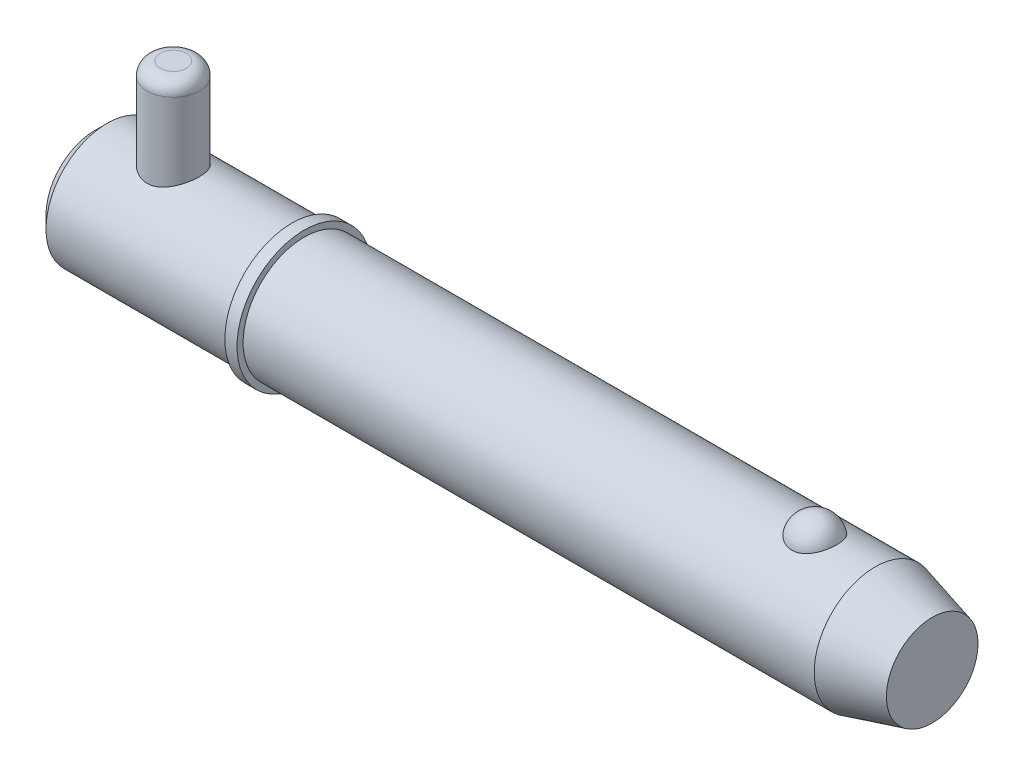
ISO-10303-21;
HEADER;
FILE_DESCRIPTION(('STEP AP214'),'2;1');
FILE_NAME('part.step','',(''),(''),'','','');
FILE_SCHEMA(('AUTOMOTIVE_DESIGN { 1 0 10303 214 1 1 1 1 }'));
ENDSEC;
DATA;
#1=APPLICATION_CONTEXT('core data for automotive mechanical design processes');
#2=APPLICATION_PROTOCOL_DEFINITION('international standard','automotive_design',2000,#1);
#3=PRODUCT_CONTEXT('',#1,'mechanical');
#4=PRODUCT('Part','Part','',(#3));
#5=PRODUCT_RELATED_PRODUCT_CATEGORY('part','',(#4));
#6=PRODUCT_DEFINITION_FORMATION('','',#4);
#7=PRODUCT_DEFINITION_CONTEXT('part definition',#1,'design');
#8=PRODUCT_DEFINITION('design','',#6,#7);
#9=PRODUCT_DEFINITION_SHAPE('','',#8);
#10=(LENGTH_UNIT() NAMED_UNIT(*) SI_UNIT(.MILLI.,.METRE.));
#11=(NAMED_UNIT(*) PLANE_ANGLE_UNIT() SI_UNIT($,.RADIAN.));
#12=(NAMED_UNIT(*) SI_UNIT($,.STERADIAN.) SOLID_ANGLE_UNIT());
#13=UNCERTAINTY_MEASURE_WITH_UNIT(LENGTH_MEASURE(1.E-05),#10,'distance_accuracy_value','');
#14=(GEOMETRIC_REPRESENTATION_CONTEXT(3) GLOBAL_UNCERTAINTY_ASSIGNED_CONTEXT((#13)) GLOBAL_UNIT_ASSIGNED_CONTEXT((#10,
#11,#12)) REPRESENTATION_CONTEXT('',''));
#15=CARTESIAN_POINT('',(0.,0.,0.));
#16=DIRECTION('',(0.,0.,1.));
#17=DIRECTION('',(1.,0.,0.));
#18=AXIS2_PLACEMENT_3D('',#15,#16,#17);
#19=CARTESIAN_POINT('',(14.28,26.985,0.));
#20=DIRECTION('',(0.,-1.,0.));
#21=DIRECTION('',(0.,0.,-1.));
#22=AXIS2_PLACEMENT_3D('',#19,#20,#21);
#23=CYLINDRICAL_SURFACE('',#22,4.76);
#24=CARTESIAN_POINT('',(14.28,-8.73500000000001,0.));
#25=DIRECTION('',(0.,1.,0.));
#26=DIRECTION('',(0.,0.,1.));
#27=AXIS2_PLACEMENT_3D('',#24,#25,#26);
#28=CIRCLE('',#27,4.76);
#29=CARTESIAN_POINT('',(14.28,-8.73500000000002,-4.76));
#30=VERTEX_POINT('',#29);
#31=EDGE_CURVE('P0_E25',#30,#30,#28,.T.);
#32=CARTESIAN_POINT('',(14.28,24.605,0.));
#33=DIRECTION('',(0.,1.,0.));
#34=DIRECTION('',(0.,0.,1.));
#35=AXIS2_PLACEMENT_3D('',#32,#33,#34);
#36=CIRCLE('',#35,4.76);
#37=CARTESIAN_POINT('',(14.28,24.605,-4.76));
#38=VERTEX_POINT('',#37);
#39=EDGE_CURVE('P0_E29',#38,#38,#36,.F.);
#40=CARTESIAN_POINT('',(14.28,-8.73500000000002,-4.76));
#41=CARTESIAN_POINT('',(14.28,-8.38770833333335,-4.76));
#42=CARTESIAN_POINT('',(14.28,-8.04041666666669,-4.76));
#43=CARTESIAN_POINT('',(14.28,-7.34583333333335,-4.76));
#44=CARTESIAN_POINT('',(14.28,-6.99854166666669,-4.76));
#45=CARTESIAN_POINT('',(14.28,-6.30395833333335,-4.76));
#46=CARTESIAN_POINT('',(14.28,-5.95666666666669,-4.76));
#47=CARTESIAN_POINT('',(14.28,-5.26208333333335,-4.76));
#48=CARTESIAN_POINT('',(14.28,-4.91479166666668,-4.76));
#49=CARTESIAN_POINT('',(14.28,-4.22020833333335,-4.76));
#50=CARTESIAN_POINT('',(14.28,-3.87291666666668,-4.76));
#51=CARTESIAN_POINT('',(14.28,-3.17833333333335,-4.76));
#52=CARTESIAN_POINT('',(14.28,-2.83104166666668,-4.76));
#53=CARTESIAN_POINT('',(14.28,-2.13645833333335,-4.76));
#54=CARTESIAN_POINT('',(14.28,-1.78916666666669,-4.76));
#55=CARTESIAN_POINT('',(14.28,-1.09458333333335,-4.76));
#56=CARTESIAN_POINT('',(14.28,-0.747291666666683,-4.76));
#57=CARTESIAN_POINT('',(14.28,-0.052708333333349,-4.76));
#58=CARTESIAN_POINT('',(14.28,0.294583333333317,-4.76));
#59=CARTESIAN_POINT('',(14.28,0.989166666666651,-4.76));
#60=CARTESIAN_POINT('',(14.28,1.33645833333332,-4.76));
#61=CARTESIAN_POINT('',(14.28,2.03104166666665,-4.76));
#62=CARTESIAN_POINT('',(14.28,2.37833333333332,-4.76));
#63=CARTESIAN_POINT('',(14.28,3.07291666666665,-4.76));
#64=CARTESIAN_POINT('',(14.28,3.42020833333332,-4.76));
#65=CARTESIAN_POINT('',(14.28,4.11479166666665,-4.76));
#66=CARTESIAN_POINT('',(14.28,4.46208333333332,-4.76));
#67=CARTESIAN_POINT('',(14.28,5.15666666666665,-4.76));
#68=CARTESIAN_POINT('',(14.28,5.50395833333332,-4.76));
#69=CARTESIAN_POINT('',(14.28,6.19854166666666,-4.76));
#70=CARTESIAN_POINT('',(14.28,6.54583333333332,-4.76));
#71=CARTESIAN_POINT('',(14.28,7.24041666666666,-4.76));
#72=CARTESIAN_POINT('',(14.28,7.58770833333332,-4.76));
#73=CARTESIAN_POINT('',(14.28,8.28229166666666,-4.76));
#74=CARTESIAN_POINT('',(14.28,8.62958333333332,-4.76));
#75=CARTESIAN_POINT('',(14.28,9.32416666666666,-4.76));
#76=CARTESIAN_POINT('',(14.28,9.67145833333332,-4.76));
#77=CARTESIAN_POINT('',(14.28,10.3660416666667,-4.76));
#78=CARTESIAN_POINT('',(14.28,10.7133333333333,-4.76));
#79=CARTESIAN_POINT('',(14.28,11.4079166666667,-4.76));
#80=CARTESIAN_POINT('',(14.28,11.7552083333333,-4.76));
#81=CARTESIAN_POINT('',(14.28,12.4497916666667,-4.76));
#82=CARTESIAN_POINT('',(14.28,12.7970833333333,-4.76));
#83=CARTESIAN_POINT('',(14.28,13.4916666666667,-4.76));
#84=CARTESIAN_POINT('',(14.28,13.8389583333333,-4.76));
#85=CARTESIAN_POINT('',(14.28,14.5335416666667,-4.76));
#86=CARTESIAN_POINT('',(14.28,14.8808333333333,-4.76));
#87=CARTESIAN_POINT('',(14.28,15.5754166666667,-4.76));
#88=CARTESIAN_POINT('',(14.28,15.9227083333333,-4.76));
#89=CARTESIAN_POINT('',(14.28,16.6172916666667,-4.76));
#90=CARTESIAN_POINT('',(14.28,16.9645833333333,-4.76));
#91=CARTESIAN_POINT('',(14.28,17.6591666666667,-4.76));
#92=CARTESIAN_POINT('',(14.28,18.0064583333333,-4.76));
#93=CARTESIAN_POINT('',(14.28,18.7010416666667,-4.76));
#94=CARTESIAN_POINT('',(14.28,19.0483333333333,-4.76));
#95=CARTESIAN_POINT('',(14.28,19.7429166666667,-4.76));
#96=CARTESIAN_POINT('',(14.28,20.0902083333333,-4.76));
#97=CARTESIAN_POINT('',(14.28,20.7847916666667,-4.76));
#98=CARTESIAN_POINT('',(14.28,21.1320833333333,-4.76));
#99=CARTESIAN_POINT('',(14.28,21.8266666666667,-4.76));
#100=CARTESIAN_POINT('',(14.28,22.1739583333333,-4.76));
#101=CARTESIAN_POINT('',(14.28,22.8685416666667,-4.76));
#102=CARTESIAN_POINT('',(14.28,23.2158333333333,-4.76));
#103=CARTESIAN_POINT('',(14.28,23.9104166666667,-4.76));
#104=CARTESIAN_POINT('',(14.28,24.2577083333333,-4.76));
#105=CARTESIAN_POINT('',(14.28,24.605,-4.76));
#106=B_SPLINE_CURVE_WITH_KNOTS('',3,(#40,#41,#42,#43,#44,#45,#46,#47,#48,#49,#50,#51,#52,#53,
#54,#55,#56,#57,#58,#59,#60,#61,#62,#63,#64,#65,#66,#67,#68,#69,#70,#71,#72,#73,#74,#75,#76,#77,
#78,#79,#80,#81,#82,#83,#84,#85,#86,#87,#88,#89,#90,#91,#92,#93,#94,#95,#96,#97,#98,#99,#100,
#101,#102,#103,#104,#105),.UNSPECIFIED.,.F.,.F.,(4,2,2,2,2,2,2,2,2,2,2,2,2,2,2,2,2,2,2,2,2,2,2,
2,2,2,2,2,2,2,2,2,4),(0.,1.041875,2.08375,3.125625,4.1675,5.209375,6.25125,7.293125,
8.33500000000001,9.376875,10.41875,11.460625,12.5025,13.544375,14.58625,15.628125,16.67,
17.711875,18.75375,19.795625,20.8375,21.879375,22.92125,23.963125,25.005,26.046875,27.08875,
28.130625,29.1725,30.214375,31.25625,32.298125,33.34),.UNSPECIFIED.);
#107=EDGE_CURVE('P0_BSEAM14',#30,#38,#106,.T.);
#108=ORIENTED_EDGE('',*,*,#31,.T.);
#109=ORIENTED_EDGE('',*,*,#39,.T.);
#110=ORIENTED_EDGE('',*,*,#107,.T.);
#111=ORIENTED_EDGE('',*,*,#107,.F.);
#112=EDGE_LOOP('',(#108,#110,#109,#111));
#113=FACE_BOUND('',#112,.T.);
#114=ADVANCED_FACE('P0_F14',(#113),#23,.T.);
#115=CARTESIAN_POINT('',(14.28,26.985,0.));
#116=DIRECTION('',(0.,1.,0.));
#117=DIRECTION('',(0.,0.,1.));
#118=AXIS2_PLACEMENT_3D('',#115,#116,#117);
#119=PLANE('',#118);
#120=CARTESIAN_POINT('',(14.28,26.985,0.));
#121=DIRECTION('',(0.,1.,0.));
#122=DIRECTION('',(0.,0.,1.));
#123=AXIS2_PLACEMENT_3D('',#120,#121,#122);
#124=CIRCLE('',#123,2.38);
#125=CARTESIAN_POINT('',(14.28,26.985,2.38));
#126=VERTEX_POINT('',#125);
#127=EDGE_CURVE('P0_E10',#126,#126,#124,.T.);
#128=ORIENTED_EDGE('',*,*,#127,.T.);
#129=EDGE_LOOP('',(#128));
#130=FACE_BOUND('',#129,.T.);
#131=ADVANCED_FACE('P0_F46',(#130),#119,.T.);
#132=CARTESIAN_POINT('',(14.28,-11.115,0.));
#133=DIRECTION('',(0.,1.,0.));
#134=DIRECTION('',(0.,0.,1.));
#135=AXIS2_PLACEMENT_3D('',#132,#133,#134);
#136=PLANE('',#135);
#137=CARTESIAN_POINT('',(14.28,-11.115,0.));
#138=DIRECTION('',(0.,1.,0.));
#139=DIRECTION('',(0.,0.,1.));
#140=AXIS2_PLACEMENT_3D('',#137,#138,#139);
#141=CIRCLE('',#140,2.38);
#142=CARTESIAN_POINT('',(14.28,-11.115,2.38));
#143=VERTEX_POINT('',#142);
#144=EDGE_CURVE('P0_E21',#143,#143,#141,.F.);
#145=ORIENTED_EDGE('',*,*,#144,.T.);
#146=EDGE_LOOP('',(#145));
#147=FACE_BOUND('',#146,.T.);
#148=ADVANCED_FACE('P0_F43',(#147),#136,.F.);
#149=CARTESIAN_POINT('',(14.28,-8.735,0.));
#150=DIRECTION('',(0.,1.,0.));
#151=DIRECTION('',(0.,0.,1.));
#152=AXIS2_PLACEMENT_3D('',#149,#150,#151);
#153=DEGENERATE_TOROIDAL_SURFACE('',#152,2.38,2.38,.T.);
#154=ORIENTED_EDGE('',*,*,#144,.F.);
#155=EDGE_LOOP('',(#154));
#156=FACE_BOUND('',#155,.T.);
#157=ORIENTED_EDGE('',*,*,#31,.F.);
#158=EDGE_LOOP('',(#157));
#159=FACE_BOUND('',#158,.T.);
#160=ADVANCED_FACE('P0_F38',(#156,#159),#153,.T.);
#161=CARTESIAN_POINT('',(14.28,24.605,0.));
#162=DIRECTION('',(0.,1.,0.));
#163=DIRECTION('',(0.,0.,1.));
#164=AXIS2_PLACEMENT_3D('',#161,#162,#163);
#165=DEGENERATE_TOROIDAL_SURFACE('',#164,2.38,2.38,.T.);
#166=ORIENTED_EDGE('',*,*,#39,.F.);
#167=EDGE_LOOP('',(#166));
#168=FACE_BOUND('',#167,.T.);
#169=ORIENTED_EDGE('',*,*,#127,.F.);
#170=EDGE_LOOP('',(#169));
#171=FACE_BOUND('',#170,.T.);
#172=ADVANCED_FACE('P0_F16',(#168,#171),#165,.T.);
#173=CLOSED_SHELL('',(#114,#131,#148,#160,#172));
#174=MANIFOLD_SOLID_BREP('P0_B1',#173);
#175=CARTESIAN_POINT('',(0.,0.,0.));
#176=DIRECTION('',(1.,0.,0.));
#177=DIRECTION('',(0.,0.,-1.));
#178=AXIS2_PLACEMENT_3D('',#175,#176,#177);
#179=CYLINDRICAL_SURFACE('',#178,11.115);
#180=CARTESIAN_POINT('',(142.029563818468,0.,0.));
#181=DIRECTION('',(1.,0.,0.));
#182=DIRECTION('',(0.,0.,-1.));
#183=AXIS2_PLACEMENT_3D('',#180,#181,#182);
#184=CIRCLE('',#183,11.115);
#185=CARTESIAN_POINT('',(142.029563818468,0.,-11.115));
#186=VERTEX_POINT('',#185);
#187=EDGE_CURVE('P1_E81',#186,#186,#184,.T.);
#188=ORIENTED_EDGE('',*,*,#187,.F.);
#189=EDGE_LOOP('',(#188));
#190=FACE_BOUND('',#189,.T.);
#191=CARTESIAN_POINT('',(38.1,0.,0.));
#192=DIRECTION('',(1.,0.,0.));
#193=DIRECTION('',(0.,0.,-1.));
#194=AXIS2_PLACEMENT_3D('',#191,#192,#193);
#195=CIRCLE('',#194,11.115);
#196=CARTESIAN_POINT('',(38.1,0.,-11.115));
#197=VERTEX_POINT('',#196);
#198=EDGE_CURVE('P1_E85',#197,#197,#195,.T.);
#199=ORIENTED_EDGE('',*,*,#198,.T.);
#200=EDGE_LOOP('',(#199));
#201=FACE_BOUND('',#200,.T.);
#202=CARTESIAN_POINT('',(131.031068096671,10.3028087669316,4.17077409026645));
#203=CARTESIAN_POINT('',(130.814775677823,10.3028003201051,4.17078240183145));
#204=CARTESIAN_POINT('',(130.598548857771,10.3098895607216,4.15340593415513));
#205=CARTESIAN_POINT('',(130.172540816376,10.3373834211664,4.08449540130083));
#206=CARTESIAN_POINT('',(129.962757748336,10.3577841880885,4.0329712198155));
#207=CARTESIAN_POINT('',(129.555782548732,10.4095237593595,3.89746513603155));
#208=CARTESIAN_POINT('',(129.358572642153,10.4408466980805,3.81353029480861));
#209=CARTESIAN_POINT('',(128.981338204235,10.5110236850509,3.61560339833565));
#210=CARTESIAN_POINT('',(128.801317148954,10.5498792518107,3.50160528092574));
#211=CARTESIAN_POINT('',(128.457684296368,10.6322884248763,3.24292464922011));
#212=CARTESIAN_POINT('',(128.294686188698,10.6759443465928,3.09746040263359));
#213=CARTESIAN_POINT('',(127.994591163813,10.7625291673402,2.7817192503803));
#214=CARTESIAN_POINT('',(127.857499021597,10.8054579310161,2.61143778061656));
#215=CARTESIAN_POINT('',(127.606408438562,10.8881935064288,2.24226695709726));
#216=CARTESIAN_POINT('',(127.493710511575,10.9277761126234,2.04244123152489));
#217=CARTESIAN_POINT('',(127.301777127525,10.997484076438,1.62578254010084));
#218=CARTESIAN_POINT('',(127.222544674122,11.0276085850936,1.40894804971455));
#219=CARTESIAN_POINT('',(127.098303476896,11.0756732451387,0.961250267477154));
#220=CARTESIAN_POINT('',(127.053760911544,11.0934470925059,0.730239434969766));
#221=CARTESIAN_POINT('',(127.001569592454,11.1143331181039,0.263439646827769));
#222=CARTESIAN_POINT('',(126.993920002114,11.1174456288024,0.0276507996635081));
#223=CARTESIAN_POINT('',(127.01561056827,11.1087161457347,-0.440729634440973));
#224=CARTESIAN_POINT('',(127.044762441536,11.0969502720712,-0.6733313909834));
#225=CARTESIAN_POINT('',(127.139143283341,11.0597872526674,-1.12996621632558));
#226=CARTESIAN_POINT('',(127.204372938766,11.0343898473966,-1.35399912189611));
#227=CARTESIAN_POINT('',(127.36969844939,10.972515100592,-1.78750286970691));
#228=CARTESIAN_POINT('',(127.46983863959,10.9360236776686,-1.99695478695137));
#229=CARTESIAN_POINT('',(127.702940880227,10.8557595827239,-2.39520667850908));
#230=CARTESIAN_POINT('',(127.835905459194,10.8119863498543,-2.58400506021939));
#231=CARTESIAN_POINT('',(128.132407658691,10.7216733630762,-2.93635726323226));
#232=CARTESIAN_POINT('',(128.296056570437,10.675123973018,-3.09981510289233));
#233=CARTESIAN_POINT('',(128.649860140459,10.5846571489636,-3.39592247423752));
#234=CARTESIAN_POINT('',(128.840012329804,10.5407394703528,-3.52857487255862));
#235=CARTESIAN_POINT('',(129.23750141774,10.4616690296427,-3.75646057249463));
#236=CARTESIAN_POINT('',(129.44436705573,10.4263443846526,-3.85245432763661));
#237=CARTESIAN_POINT('',(129.872954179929,10.3675574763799,-4.00798747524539));
#238=CARTESIAN_POINT('',(130.094670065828,10.344090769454,-4.0675405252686));
#239=CARTESIAN_POINT('',(130.534669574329,10.3128282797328,-4.14614314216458));
#240=CARTESIAN_POINT('',(130.752565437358,10.3043040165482,-4.1670783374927));
#241=CARTESIAN_POINT('',(131.18894951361,10.3016771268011,-4.17357158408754));
#242=CARTESIAN_POINT('',(131.407437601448,10.3075716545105,-4.15913661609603));
#243=CARTESIAN_POINT('',(131.831744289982,10.3326686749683,-4.09636961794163));
#244=CARTESIAN_POINT('',(132.037745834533,10.3514555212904,-4.0490957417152));
#245=CARTESIAN_POINT('',(132.438576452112,10.399818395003,-3.92320197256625));
#246=CARTESIAN_POINT('',(132.6334046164,10.4293952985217,-3.84457953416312));
#247=CARTESIAN_POINT('',(133.011191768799,10.4969600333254,-3.65612410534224));
#248=CARTESIAN_POINT('',(133.193797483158,10.5351178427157,-3.54564545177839));
#249=CARTESIAN_POINT('',(133.538204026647,10.6154999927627,-3.29718036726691));
#250=CARTESIAN_POINT('',(133.700000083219,10.657725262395,-3.15918764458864));
#251=CARTESIAN_POINT('',(134.006959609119,10.744212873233,-2.85163580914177));
#252=CARTESIAN_POINT('',(134.150891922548,10.7884718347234,-2.68084605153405));
#253=CARTESIAN_POINT('',(134.409237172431,10.872374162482,-2.31721864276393));
#254=CARTESIAN_POINT('',(134.523644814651,10.9120167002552,-2.12437704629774));
#255=CARTESIAN_POINT('',(134.723873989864,10.9838919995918,-1.71516999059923));
#256=CARTESIAN_POINT('',(134.80866178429,11.0158465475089,-1.49824866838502));
#257=CARTESIAN_POINT('',(134.94268382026,11.0673523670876,-1.05228572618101));
#258=CARTESIAN_POINT('',(134.991917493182,11.086903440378,-0.823243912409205));
#259=CARTESIAN_POINT('',(135.053891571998,11.1116323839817,-0.359087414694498));
#260=CARTESIAN_POINT('',(135.066566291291,11.1167843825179,-0.12396256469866));
#261=CARTESIAN_POINT('',(135.054973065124,11.1121144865,0.345220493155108));
#262=CARTESIAN_POINT('',(135.030705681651,11.1022928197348,0.579278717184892));
#263=CARTESIAN_POINT('',(134.945907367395,11.0687504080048,1.03866534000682));
#264=CARTESIAN_POINT('',(134.885529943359,11.0450885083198,1.26402641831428));
#265=CARTESIAN_POINT('',(134.729853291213,10.9863185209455,1.70076772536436));
#266=CARTESIAN_POINT('',(134.634551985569,10.9512097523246,1.91214712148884));
#267=CARTESIAN_POINT('',(134.410397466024,10.8729733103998,2.316083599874));
#268=CARTESIAN_POINT('',(134.281380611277,10.8298068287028,2.50854240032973));
#269=CARTESIAN_POINT('',(133.992732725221,10.7401896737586,2.86808766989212));
#270=CARTESIAN_POINT('',(133.833102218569,10.6937390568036,3.03517457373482));
#271=CARTESIAN_POINT('',(133.487534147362,10.6029321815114,3.33857581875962));
#272=CARTESIAN_POINT('',(133.301708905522,10.5585680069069,3.47501541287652));
#273=CARTESIAN_POINT('',(132.907875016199,10.4769321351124,3.71390897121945));
#274=CARTESIAN_POINT('',(132.699863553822,10.439661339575,3.81635861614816));
#275=CARTESIAN_POINT('',(132.254066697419,10.3749407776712,3.98910631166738));
#276=CARTESIAN_POINT('',(132.015234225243,10.3482457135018,4.05700929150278));
#277=CARTESIAN_POINT('',(131.527925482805,10.312188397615,4.14782844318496));
#278=CARTESIAN_POINT('',(131.279453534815,10.3028184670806,4.17076454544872));
#279=CARTESIAN_POINT('',(131.031068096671,10.3028087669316,4.17077409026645));
#280=B_SPLINE_CURVE_WITH_KNOTS('',3,(#202,#203,#204,#205,#206,#207,#208,#209,#210,#211,#212,
#213,#214,#215,#216,#217,#218,#219,#220,#221,#222,#223,#224,#225,#226,#227,#228,#229,#230,#231,
#232,#233,#234,#235,#236,#237,#238,#239,#240,#241,#242,#243,#244,#245,#246,#247,#248,#249,#250,
#251,#252,#253,#254,#255,#256,#257,#258,#259,#260,#261,#262,#263,#264,#265,#266,#267,#268,#269,
#270,#271,#272,#273,#274,#275,#276,#277,#278,#279),.UNSPECIFIED.,.T.,.F.,(4,2,2,2,2,2,2,2,2,2,2,
2,2,2,2,2,2,2,2,2,2,2,2,2,2,2,2,2,2,2,2,2,2,2,2,2,2,2,4),(0.,0.64796614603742,1.29574482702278,
1.94258643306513,2.58955857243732,3.25496465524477,3.92049326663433,4.61566368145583,
5.31089647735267,6.01531821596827,6.71972398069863,7.42054043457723,8.12137023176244,
8.82309331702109,9.52487047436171,10.2292439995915,10.9335519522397,11.6223330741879,
12.3108558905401,12.9647664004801,13.6185478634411,14.252184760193,14.8858731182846,
15.5334360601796,16.1811472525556,16.8611459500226,17.5412664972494,18.2431855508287,
18.9451158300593,19.6483065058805,20.3514864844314,21.0516982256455,21.7519516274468,
22.4556690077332,23.1593743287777,23.860149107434,24.5610129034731,25.3054529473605,
26.049562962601),.UNSPECIFIED.);
#281=CARTESIAN_POINT('',(131.031068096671,10.3028087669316,4.17077409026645));
#282=VERTEX_POINT('',#281);
#283=EDGE_CURVE('P1_E35',#282,#282,#280,.T.);
#284=ORIENTED_EDGE('',*,*,#283,.T.);
#285=EDGE_LOOP('',(#284));
#286=FACE_BOUND('',#285,.T.);
#287=ADVANCED_FACE('P1_F13',(#190,#201,#286),#179,.T.);
#288=CARTESIAN_POINT('',(0.,0.,0.));
#289=DIRECTION('',(-1.,0.,0.));
#290=DIRECTION('',(0.,0.,1.));
#291=AXIS2_PLACEMENT_3D('',#288,#289,#290);
#292=PLANE('',#291);
#293=CARTESIAN_POINT('',(0.,0.,0.));
#294=DIRECTION('',(1.,0.,0.));
#295=DIRECTION('',(0.,0.,-1.));
#296=AXIS2_PLACEMENT_3D('',#293,#294,#295);
#297=CIRCLE('',#296,8.892);
#298=CARTESIAN_POINT('',(0.,0.,-8.892));
#299=VERTEX_POINT('',#298);
#300=EDGE_CURVE('P1_E9',#299,#299,#297,.T.);
#301=ORIENTED_EDGE('',*,*,#300,.F.);
#302=EDGE_LOOP('',(#301));
#303=FACE_BOUND('',#302,.T.);
#304=ADVANCED_FACE('P1_F15',(#303),#292,.T.);
#305=CARTESIAN_POINT('',(2.22299999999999,0.,0.));
#306=DIRECTION('',(1.,0.,0.));
#307=DIRECTION('',(0.,0.,-1.));
#308=AXIS2_PLACEMENT_3D('',#305,#306,#307);
#309=CONICAL_SURFACE('',#308,11.115,0.78539816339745);
#310=ORIENTED_EDGE('',*,*,#300,.T.);
#311=EDGE_LOOP('',(#310));
#312=FACE_BOUND('',#311,.T.);
#313=CARTESIAN_POINT('',(2.22299999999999,0.,0.));
#314=DIRECTION('',(1.,0.,0.));
#315=DIRECTION('',(0.,0.,-1.));
#316=AXIS2_PLACEMENT_3D('',#313,#314,#315);
#317=CIRCLE('',#316,11.115);
#318=CARTESIAN_POINT('',(2.22299999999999,0.,-11.115));
#319=VERTEX_POINT('',#318);
#320=EDGE_CURVE('P1_E26',#319,#319,#317,.T.);
#321=ORIENTED_EDGE('',*,*,#320,.F.);
#322=EDGE_LOOP('',(#321));
#323=FACE_BOUND('',#322,.T.);
#324=ADVANCED_FACE('P1_F77',(#312,#323),#309,.T.);
#325=CARTESIAN_POINT('',(0.,0.,0.));
#326=DIRECTION('',(1.,0.,0.));
#327=DIRECTION('',(0.,0.,-1.));
#328=AXIS2_PLACEMENT_3D('',#325,#326,#327);
#329=CYLINDRICAL_SURFACE('',#328,11.115);
#330=CARTESIAN_POINT('',(14.28,-10.0441836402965,4.76));
#331=CARTESIAN_POINT('',(14.1533731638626,-10.0441846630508,4.75999904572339));
#332=CARTESIAN_POINT('',(14.0267055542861,-10.0465865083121,4.75493985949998));
#333=CARTESIAN_POINT('',(13.774298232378,-10.0561141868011,4.73475585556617));
#334=CARTESIAN_POINT('',(13.6485591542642,-10.0632429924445,4.71962470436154));
#335=CARTESIAN_POINT('',(13.3987500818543,-10.0819979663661,4.67942666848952));
#336=CARTESIAN_POINT('',(13.2746840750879,-10.0936334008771,4.65433930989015));
#337=CARTESIAN_POINT('',(13.0293244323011,-10.1210146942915,4.59449317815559));
#338=CARTESIAN_POINT('',(12.9080319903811,-10.1367622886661,4.55973032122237));
#339=CARTESIAN_POINT('',(12.669614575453,-10.1717810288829,4.48106435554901));
#340=CARTESIAN_POINT('',(12.5524727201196,-10.1910352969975,4.4372048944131));
#341=CARTESIAN_POINT('',(12.3224300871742,-10.2325403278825,4.34063417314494));
#342=CARTESIAN_POINT('',(12.2095309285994,-10.2547922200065,4.28791957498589));
#343=CARTESIAN_POINT('',(11.8782785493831,-10.3250879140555,4.11715127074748));
#344=CARTESIAN_POINT('',(11.6670799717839,-10.3767168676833,3.98637638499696));
#345=CARTESIAN_POINT('',(11.2564039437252,-10.4874309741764,3.68567149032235));
#346=CARTESIAN_POINT('',(11.0583793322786,-10.5467772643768,3.51386978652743));
#347=CARTESIAN_POINT('',(10.6927724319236,-10.6641377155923,3.13969960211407));
#348=CARTESIAN_POINT('',(10.5252022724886,-10.7221513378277,2.93731900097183));
#349=CARTESIAN_POINT('',(10.2965609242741,-10.8050020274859,2.60935726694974));
#350=CARTESIAN_POINT('',(10.2227768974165,-10.8324811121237,2.49310321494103));
#351=CARTESIAN_POINT('',(10.0853380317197,-10.884703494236,2.25418999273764));
#352=CARTESIAN_POINT('',(10.0216789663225,-10.9094479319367,2.13153352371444));
#353=CARTESIAN_POINT('',(9.90506238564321,-10.9554932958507,1.88060370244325));
#354=CARTESIAN_POINT('',(9.85210574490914,-10.9767939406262,1.7523298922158));
#355=CARTESIAN_POINT('',(9.75746464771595,-11.0153112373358,1.49115740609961));
#356=CARTESIAN_POINT('',(9.71577447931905,-11.0325299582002,1.35826111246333));
#357=CARTESIAN_POINT('',(9.64605475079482,-11.0615607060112,1.09614539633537));
#358=CARTESIAN_POINT('',(9.61740732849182,-11.0736151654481,0.96711700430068));
#359=CARTESIAN_POINT('',(9.57092026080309,-11.0932687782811,0.706847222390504));
#360=CARTESIAN_POINT('',(9.55307574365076,-11.1008699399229,0.575606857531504));
#361=CARTESIAN_POINT('',(9.52838640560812,-11.1114054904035,0.31192917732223));
#362=CARTESIAN_POINT('',(9.52153986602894,-11.114340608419,0.179492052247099));
#363=CARTESIAN_POINT('',(9.51892405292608,-11.1154607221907,-0.0855090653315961));
#364=CARTESIAN_POINT('',(9.52315432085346,-11.1136459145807,-0.218073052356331));
#365=CARTESIAN_POINT('',(9.542009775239,-11.1055891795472,-0.473709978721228));
#366=CARTESIAN_POINT('',(9.55594693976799,-11.099640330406,-0.596843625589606));
#367=CARTESIAN_POINT('',(9.59332832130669,-11.0837823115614,-0.841440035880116));
#368=CARTESIAN_POINT('',(9.61677567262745,-11.0738718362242,-0.962902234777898));
#369=CARTESIAN_POINT('',(9.67294089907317,-11.0503378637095,-1.20325684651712));
#370=CARTESIAN_POINT('',(9.70565569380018,-11.0367156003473,-1.32215009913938));
#371=CARTESIAN_POINT('',(9.78005008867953,-11.0060908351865,-1.55666640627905));
#372=CARTESIAN_POINT('',(9.82173311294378,-10.9890870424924,-1.67228819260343));
#373=CARTESIAN_POINT('',(9.96110379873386,-10.9330280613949,-2.01656166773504));
#374=CARTESIAN_POINT('',(10.0722987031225,-10.8892801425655,-2.23915547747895));
#375=CARTESIAN_POINT('',(10.3268588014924,-10.7934745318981,-2.66299199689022));
#376=CARTESIAN_POINT('',(10.4702355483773,-10.7414138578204,-2.86422700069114));
#377=CARTESIAN_POINT('',(10.7973904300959,-10.6296201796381,-3.25557775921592));
#378=CARTESIAN_POINT('',(10.9833705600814,-10.569604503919,-3.443774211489));
#379=CARTESIAN_POINT('',(11.3844486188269,-10.4514707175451,-3.78722133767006));
#380=CARTESIAN_POINT('',(11.5995590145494,-10.3933534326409,-3.94245783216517));
#381=CARTESIAN_POINT('',(11.9444340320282,-10.311516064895,-4.14990014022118));
#382=CARTESIAN_POINT('',(12.0654579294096,-10.2847012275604,-4.21573894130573));
#383=CARTESIAN_POINT('',(12.3132718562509,-10.2342051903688,-4.33688518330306));
#384=CARTESIAN_POINT('',(12.4400593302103,-10.2105226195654,-4.39219723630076));
#385=CARTESIAN_POINT('',(12.6985418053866,-10.1671237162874,-4.49174500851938));
#386=CARTESIAN_POINT('',(12.8302359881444,-10.1474067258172,-4.53598256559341));
#387=CARTESIAN_POINT('',(13.0975061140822,-10.1126841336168,-4.61287629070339));
#388=CARTESIAN_POINT('',(13.233079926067,-10.0976759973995,-4.64553869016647));
#389=CARTESIAN_POINT('',(13.4978553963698,-10.0737863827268,-4.6971059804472));
#390=CARTESIAN_POINT('',(13.6268754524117,-10.0645618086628,-4.716785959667));
#391=CARTESIAN_POINT('',(13.8862990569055,-10.051062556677,-4.74548419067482));
#392=CARTESIAN_POINT('',(14.0167019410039,-10.0467856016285,-4.75450734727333));
#393=CARTESIAN_POINT('',(14.277859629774,-10.0433352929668,-4.76179143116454));
#394=CARTESIAN_POINT('',(14.4086143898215,-10.0441613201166,-4.76005366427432));
#395=CARTESIAN_POINT('',(14.6694025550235,-10.0508838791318,-4.74584231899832));
#396=CARTESIAN_POINT('',(14.7994359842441,-10.0567802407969,-4.73336910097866));
#397=CARTESIAN_POINT('',(15.0487369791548,-10.0728449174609,-4.69907984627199));
#398=CARTESIAN_POINT('',(15.1681238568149,-10.0826872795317,-4.67797462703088));
#399=CARTESIAN_POINT('',(15.4045894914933,-10.1062580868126,-4.62682977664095));
#400=CARTESIAN_POINT('',(15.5216674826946,-10.1199877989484,-4.59678723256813));
#401=CARTESIAN_POINT('',(15.868278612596,-10.1664161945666,-4.49365911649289));
#402=CARTESIAN_POINT('',(16.0933756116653,-10.2043671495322,-4.40754694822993));
#403=CARTESIAN_POINT('',(16.5357981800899,-10.2919879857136,-4.19898201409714));
#404=CARTESIAN_POINT('',(16.7523611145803,-10.3420954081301,-4.07511281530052));
#405=CARTESIAN_POINT('',(17.1627188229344,-10.4477911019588,-3.7959429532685));
#406=CARTESIAN_POINT('',(17.3565033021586,-10.5033818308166,-3.64062816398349));
#407=CARTESIAN_POINT('',(17.7334034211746,-10.6196376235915,-3.28693729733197));
#408=CARTESIAN_POINT('',(17.9141276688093,-10.6803237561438,-3.08599175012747));
#409=CARTESIAN_POINT('',(18.1582189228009,-10.7666348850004,-2.76320365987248));
#410=CARTESIAN_POINT('',(18.2351223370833,-10.7946346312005,-2.65197124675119));
#411=CARTESIAN_POINT('',(18.3793967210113,-10.8483267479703,-2.42297927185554));
#412=CARTESIAN_POINT('',(18.4467718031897,-10.87402011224,-2.30522255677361));
#413=CARTESIAN_POINT('',(18.5717669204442,-10.9225249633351,-2.06324665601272));
#414=CARTESIAN_POINT('',(18.6293326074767,-10.9453202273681,-1.93899615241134));
#415=CARTESIAN_POINT('',(18.73370006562,-10.9872100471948,-1.6855059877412));
#416=CARTESIAN_POINT('',(18.7805065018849,-11.0063062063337,-1.55626851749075));
#417=CARTESIAN_POINT('',(18.8628731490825,-11.0402419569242,-1.29375150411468));
#418=CARTESIAN_POINT('',(18.8984366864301,-11.0550828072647,-1.16047316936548));
#419=CARTESIAN_POINT('',(18.9579183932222,-11.0800638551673,-0.890912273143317));
#420=CARTESIAN_POINT('',(18.9818374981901,-11.0902044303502,-0.75462995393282));
#421=CARTESIAN_POINT('',(19.0164177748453,-11.104911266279,-0.490295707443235));
#422=CARTESIAN_POINT('',(19.027922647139,-11.1098318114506,-0.362373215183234));
#423=CARTESIAN_POINT('',(19.040554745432,-11.1152360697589,-0.105876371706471));
#424=CARTESIAN_POINT('',(19.0416784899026,-11.1157182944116,0.0226981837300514));
#425=CARTESIAN_POINT('',(19.0335275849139,-11.1122291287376,0.27938352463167));
#426=CARTESIAN_POINT('',(19.0242587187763,-11.1082602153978,0.407494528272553));
#427=CARTESIAN_POINT('',(18.9954320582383,-11.0959792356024,0.662388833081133));
#428=CARTESIAN_POINT('',(18.9758704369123,-11.0876655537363,0.789171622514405));
#429=CARTESIAN_POINT('',(18.9276379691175,-11.0673259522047,1.03545890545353));
#430=CARTESIAN_POINT('',(18.8993573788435,-11.0554596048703,1.15505309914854));
#431=CARTESIAN_POINT('',(18.8337694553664,-11.0282166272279,1.39134516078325));
#432=CARTESIAN_POINT('',(18.7964589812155,-11.0128387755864,1.5080420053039));
#433=CARTESIAN_POINT('',(18.671464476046,-10.9619666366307,1.85262797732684));
#434=CARTESIAN_POINT('',(18.5706772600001,-10.9217161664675,2.07521484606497));
#435=CARTESIAN_POINT('',(18.33202463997,-10.8301378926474,2.51061719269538));
#436=CARTESIAN_POINT('',(18.1926775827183,-10.7783885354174,2.72252375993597));
#437=CARTESIAN_POINT('',(17.8829747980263,-10.669863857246,3.12088015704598));
#438=CARTESIAN_POINT('',(17.7126068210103,-10.6130865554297,3.30731987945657));
#439=CARTESIAN_POINT('',(17.3310036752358,-10.495668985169,3.66358491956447));
#440=CARTESIAN_POINT('',(17.1177010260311,-10.4350471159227,3.83122543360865));
#441=CARTESIAN_POINT('',(16.7778915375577,-10.3495418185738,4.05420569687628));
#442=CARTESIAN_POINT('',(16.6612023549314,-10.3219229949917,4.12383380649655));
#443=CARTESIAN_POINT('',(16.4218466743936,-10.2693487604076,4.25306463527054));
#444=CARTESIAN_POINT('',(16.2991829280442,-10.2443921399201,4.31267191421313));
#445=CARTESIAN_POINT('',(16.0488008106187,-10.1979981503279,4.42126071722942));
#446=CARTESIAN_POINT('',(15.9210894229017,-10.1765561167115,4.47025635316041));
#447=CARTESIAN_POINT('',(15.6613937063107,-10.1379191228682,4.55720152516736));
#448=CARTESIAN_POINT('',(15.5294115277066,-10.1207220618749,4.59515652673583));
#449=CARTESIAN_POINT('',(15.2624981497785,-10.091252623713,4.65951684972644));
#450=CARTESIAN_POINT('',(15.1275757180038,-10.0789672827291,4.68595259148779));
#451=CARTESIAN_POINT('',(14.8556442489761,-10.0597530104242,4.72706206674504));
#452=CARTESIAN_POINT('',(14.7186368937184,-10.0528199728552,4.74174481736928));
#453=CARTESIAN_POINT('',(14.5310955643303,-10.047196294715,4.75363843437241));
#454=CARTESIAN_POINT('',(14.48091543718,-10.0460674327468,4.75602323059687));
#455=CARTESIAN_POINT('',(14.3804923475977,-10.044560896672,4.7592042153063));
#456=CARTESIAN_POINT('',(14.3302493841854,-10.0441832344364,4.76000037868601));
#457=CARTESIAN_POINT('',(14.28,-10.0441836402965,4.76));
#458=B_SPLINE_CURVE_WITH_KNOTS('',3,(#330,#331,#332,#333,#334,#335,#336,#337,#338,#339,#340,
#341,#342,#343,#344,#345,#346,#347,#348,#349,#350,#351,#352,#353,#354,#355,#356,#357,#358,#359,
#360,#361,#362,#363,#364,#365,#366,#367,#368,#369,#370,#371,#372,#373,#374,#375,#376,#377,#378,
#379,#380,#381,#382,#383,#384,#385,#386,#387,#388,#389,#390,#391,#392,#393,#394,#395,#396,#397,
#398,#399,#400,#401,#402,#403,#404,#405,#406,#407,#408,#409,#410,#411,#412,#413,#414,#415,#416,
#417,#418,#419,#420,#421,#422,#423,#424,#425,#426,#427,#428,#429,#430,#431,#432,#433,#434,#435,
#436,#437,#438,#439,#440,#441,#442,#443,#444,#445,#446,#447,#448,#449,#450,#451,#452,#453,#454,
#455,#456,#457),.UNSPECIFIED.,.T.,.F.,(4,2,2,2,2,2,2,2,2,2,2,2,2,2,2,2,2,2,2,2,2,2,2,2,2,2,2,2,
2,2,2,2,2,2,2,2,2,2,2,2,2,2,2,2,2,2,2,2,2,2,2,2,2,2,2,2,2,2,2,2,2,2,2,4),(0.,0.379828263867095,
0.759895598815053,1.14074858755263,1.52176256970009,1.90098898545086,2.28035867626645,
3.03818035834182,3.84125131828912,4.6446414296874,5.06541657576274,5.48601561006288,
5.90664899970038,6.3270687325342,6.72470503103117,7.12216187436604,7.51955659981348,
7.91693487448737,8.28868404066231,8.66055582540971,9.03230414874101,9.40419465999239,
10.1585834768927,10.9132435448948,11.7236471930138,12.5343987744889,12.9550196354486,
13.3754557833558,13.7958221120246,14.2159617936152,14.6079540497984,14.9997658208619,
15.3915300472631,15.7832811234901,16.1477615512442,16.512360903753,17.240999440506,
18.0012974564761,18.761937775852,19.5886929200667,20.0025782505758,20.4162843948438,
20.832212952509,21.2479608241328,21.6635855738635,22.0791769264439,22.4642880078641,
22.8495282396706,23.2345541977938,23.6197234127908,23.9896813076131,24.3597680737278,
25.099327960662,25.8726239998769,26.6462260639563,27.4759193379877,27.8914891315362,
28.3068693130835,28.7216936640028,29.1363123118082,29.5498292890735,29.9630287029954,
30.113753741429,30.2644811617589),.UNSPECIFIED.);
#459=CARTESIAN_POINT('',(14.28,-10.0441836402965,4.76));
#460=VERTEX_POINT('',#459);
#461=EDGE_CURVE('P1_E17',#460,#460,#458,.T.);
#462=ORIENTED_EDGE('',*,*,#461,.F.);
#463=EDGE_LOOP('',(#462));
#464=FACE_BOUND('',#463,.T.);
#465=CARTESIAN_POINT('',(14.28,10.0441836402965,4.76));
#466=CARTESIAN_POINT('',(14.4066268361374,10.0441846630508,4.75999904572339));
#467=CARTESIAN_POINT('',(14.5332944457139,10.0465865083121,4.75493985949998));
#468=CARTESIAN_POINT('',(14.785701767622,10.0561141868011,4.73475585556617));
#469=CARTESIAN_POINT('',(14.9114408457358,10.0632429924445,4.71962470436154));
#470=CARTESIAN_POINT('',(15.1612499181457,10.0819979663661,4.67942666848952));
#471=CARTESIAN_POINT('',(15.2853159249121,10.0936334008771,4.65433930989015));
#472=CARTESIAN_POINT('',(15.5306755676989,10.1210146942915,4.59449317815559));
#473=CARTESIAN_POINT('',(15.6519680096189,10.1367622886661,4.55973032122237));
#474=CARTESIAN_POINT('',(15.890385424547,10.1717810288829,4.48106435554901));
#475=CARTESIAN_POINT('',(16.0075272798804,10.1910352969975,4.4372048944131));
#476=CARTESIAN_POINT('',(16.2375699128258,10.2325403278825,4.34063417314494));
#477=CARTESIAN_POINT('',(16.3504690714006,10.2547922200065,4.28791957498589));
#478=CARTESIAN_POINT('',(16.6817214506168,10.3250879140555,4.11715127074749));
#479=CARTESIAN_POINT('',(16.8929200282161,10.3767168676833,3.98637638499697));
#480=CARTESIAN_POINT('',(17.3035960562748,10.4874309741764,3.68567149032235));
#481=CARTESIAN_POINT('',(17.5016206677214,10.5467772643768,3.51386978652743));
#482=CARTESIAN_POINT('',(17.8672275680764,10.6641377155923,3.13969960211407));
#483=CARTESIAN_POINT('',(18.0347977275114,10.7221513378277,2.93731900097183));
#484=CARTESIAN_POINT('',(18.2634390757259,10.8050020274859,2.60935726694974));
#485=CARTESIAN_POINT('',(18.3372231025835,10.8324811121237,2.49310321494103));
#486=CARTESIAN_POINT('',(18.4746619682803,10.884703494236,2.25418999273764));
#487=CARTESIAN_POINT('',(18.5383210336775,10.9094479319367,2.13153352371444));
#488=CARTESIAN_POINT('',(18.6549376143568,10.9554932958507,1.88060370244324));
#489=CARTESIAN_POINT('',(18.7078942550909,10.9767939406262,1.75232989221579));
#490=CARTESIAN_POINT('',(18.8025353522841,11.0153112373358,1.4911574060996));
#491=CARTESIAN_POINT('',(18.844225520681,11.0325299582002,1.35826111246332));
#492=CARTESIAN_POINT('',(18.9139452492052,11.0615607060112,1.09614539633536));
#493=CARTESIAN_POINT('',(18.9425926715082,11.0736151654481,0.967117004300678));
#494=CARTESIAN_POINT('',(18.9890797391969,11.0932687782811,0.706847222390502));
#495=CARTESIAN_POINT('',(19.0069242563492,11.1008699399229,0.575606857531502));
#496=CARTESIAN_POINT('',(19.0316135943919,11.1114054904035,0.311929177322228));
#497=CARTESIAN_POINT('',(19.0384601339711,11.114340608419,0.179492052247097));
#498=CARTESIAN_POINT('',(19.0410759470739,11.1154607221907,-0.0855090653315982));
#499=CARTESIAN_POINT('',(19.0368456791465,11.1136459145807,-0.218073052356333));
#500=CARTESIAN_POINT('',(19.017990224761,11.1055891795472,-0.47370997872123));
#501=CARTESIAN_POINT('',(19.004053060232,11.099640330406,-0.596843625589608));
#502=CARTESIAN_POINT('',(18.9666716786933,11.0837823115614,-0.841440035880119));
#503=CARTESIAN_POINT('',(18.9432243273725,11.0738718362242,-0.9629022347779));
#504=CARTESIAN_POINT('',(18.8870591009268,11.0503378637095,-1.20325684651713));
#505=CARTESIAN_POINT('',(18.8543443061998,11.0367156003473,-1.32215009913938));
#506=CARTESIAN_POINT('',(18.7799499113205,11.0060908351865,-1.55666640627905));
#507=CARTESIAN_POINT('',(18.7382668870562,10.9890870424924,-1.67228819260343));
#508=CARTESIAN_POINT('',(18.5988962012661,10.9330280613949,-2.01656166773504));
#509=CARTESIAN_POINT('',(18.4877012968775,10.8892801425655,-2.23915547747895));
#510=CARTESIAN_POINT('',(18.2331411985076,10.7934745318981,-2.66299199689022));
#511=CARTESIAN_POINT('',(18.0897644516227,10.7414138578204,-2.86422700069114));
#512=CARTESIAN_POINT('',(17.7626095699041,10.6296201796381,-3.25557775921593));
#513=CARTESIAN_POINT('',(17.5766294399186,10.569604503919,-3.443774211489));
#514=CARTESIAN_POINT('',(17.1755513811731,10.4514707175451,-3.78722133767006));
#515=CARTESIAN_POINT('',(16.9604409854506,10.3933534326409,-3.94245783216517));
#516=CARTESIAN_POINT('',(16.6155659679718,10.311516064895,-4.14990014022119));
#517=CARTESIAN_POINT('',(16.4945420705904,10.2847012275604,-4.21573894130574));
#518=CARTESIAN_POINT('',(16.2467281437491,10.2342051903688,-4.33688518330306));
#519=CARTESIAN_POINT('',(16.1199406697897,10.2105226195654,-4.39219723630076));
#520=CARTESIAN_POINT('',(15.8614581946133,10.1671237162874,-4.49174500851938));
#521=CARTESIAN_POINT('',(15.7297640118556,10.1474067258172,-4.53598256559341));
#522=CARTESIAN_POINT('',(15.4624938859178,10.1126841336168,-4.61287629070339));
#523=CARTESIAN_POINT('',(15.326920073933,10.0976759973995,-4.64553869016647));
#524=CARTESIAN_POINT('',(15.0621446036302,10.0737863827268,-4.6971059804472));
#525=CARTESIAN_POINT('',(14.9331245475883,10.0645618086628,-4.716785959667));
#526=CARTESIAN_POINT('',(14.6737009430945,10.051062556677,-4.74548419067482));
#527=CARTESIAN_POINT('',(14.543298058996,10.0467856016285,-4.75450734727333));
#528=CARTESIAN_POINT('',(14.2821403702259,10.0433352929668,-4.76179143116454));
#529=CARTESIAN_POINT('',(14.1513856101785,10.0441613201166,-4.76005366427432));
#530=CARTESIAN_POINT('',(13.8905974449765,10.0508838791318,-4.74584231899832));
#531=CARTESIAN_POINT('',(13.7605640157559,10.0567802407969,-4.73336910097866));
#532=CARTESIAN_POINT('',(13.5112630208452,10.0728449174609,-4.69907984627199));
#533=CARTESIAN_POINT('',(13.3918761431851,10.0826872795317,-4.67797462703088));
#534=CARTESIAN_POINT('',(13.1554105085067,10.1062580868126,-4.62682977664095));
#535=CARTESIAN_POINT('',(13.0383325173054,10.1199877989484,-4.59678723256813));
#536=CARTESIAN_POINT('',(12.691721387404,10.1664161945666,-4.49365911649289));
#537=CARTESIAN_POINT('',(12.4666243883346,10.2043671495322,-4.40754694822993));
#538=CARTESIAN_POINT('',(12.0242018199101,10.2919879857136,-4.19898201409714));
#539=CARTESIAN_POINT('',(11.8076388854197,10.3420954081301,-4.07511281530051));
#540=CARTESIAN_POINT('',(11.3972811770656,10.4477911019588,-3.7959429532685));
#541=CARTESIAN_POINT('',(11.2034966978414,10.5033818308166,-3.64062816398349));
#542=CARTESIAN_POINT('',(10.8265965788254,10.6196376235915,-3.28693729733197));
#543=CARTESIAN_POINT('',(10.6458723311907,10.6803237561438,-3.08599175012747));
#544=CARTESIAN_POINT('',(10.4017810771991,10.7666348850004,-2.76320365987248));
#545=CARTESIAN_POINT('',(10.3248776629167,10.7946346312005,-2.65197124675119));
#546=CARTESIAN_POINT('',(10.1806032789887,10.8483267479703,-2.42297927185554));
#547=CARTESIAN_POINT('',(10.1132281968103,10.87402011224,-2.30522255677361));
#548=CARTESIAN_POINT('',(9.98823307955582,10.9225249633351,-2.06324665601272));
#549=CARTESIAN_POINT('',(9.93066739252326,10.9453202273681,-1.93899615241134));
#550=CARTESIAN_POINT('',(9.82629993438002,10.9872100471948,-1.6855059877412));
#551=CARTESIAN_POINT('',(9.77949349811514,11.0063062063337,-1.55626851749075));
#552=CARTESIAN_POINT('',(9.69712685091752,11.0402419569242,-1.29375150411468));
#553=CARTESIAN_POINT('',(9.66156331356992,11.0550828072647,-1.16047316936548));
#554=CARTESIAN_POINT('',(9.60208160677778,11.0800638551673,-0.890912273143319));
#555=CARTESIAN_POINT('',(9.57816250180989,11.0902044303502,-0.754629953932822));
#556=CARTESIAN_POINT('',(9.54358222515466,11.104911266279,-0.490295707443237));
#557=CARTESIAN_POINT('',(9.53207735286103,11.1098318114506,-0.362373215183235));
#558=CARTESIAN_POINT('',(9.51944525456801,11.1152360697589,-0.105876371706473));
#559=CARTESIAN_POINT('',(9.51832151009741,11.1157182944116,0.0226981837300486));
#560=CARTESIAN_POINT('',(9.52647241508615,11.1122291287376,0.279383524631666));
#561=CARTESIAN_POINT('',(9.53574128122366,11.1082602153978,0.407494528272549));
#562=CARTESIAN_POINT('',(9.5645679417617,11.0959792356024,0.662388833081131));
#563=CARTESIAN_POINT('',(9.58412956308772,11.0876655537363,0.789171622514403));
#564=CARTESIAN_POINT('',(9.63236203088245,11.0673259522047,1.03545890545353));
#565=CARTESIAN_POINT('',(9.66064262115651,11.0554596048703,1.15505309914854));
#566=CARTESIAN_POINT('',(9.72623054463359,11.0282166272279,1.39134516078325));
#567=CARTESIAN_POINT('',(9.76354101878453,11.0128387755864,1.5080420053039));
#568=CARTESIAN_POINT('',(9.88853552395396,10.9619666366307,1.85262797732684));
#569=CARTESIAN_POINT('',(9.98932273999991,10.9217161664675,2.07521484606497));
#570=CARTESIAN_POINT('',(10.22797536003,10.8301378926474,2.51061719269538));
#571=CARTESIAN_POINT('',(10.3673224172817,10.7783885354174,2.72252375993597));
#572=CARTESIAN_POINT('',(10.6770252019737,10.669863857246,3.12088015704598));
#573=CARTESIAN_POINT('',(10.8473931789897,10.6130865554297,3.30731987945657));
#574=CARTESIAN_POINT('',(11.2289963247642,10.495668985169,3.66358491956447));
#575=CARTESIAN_POINT('',(11.4422989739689,10.4350471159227,3.83122543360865));
#576=CARTESIAN_POINT('',(11.7821084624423,10.3495418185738,4.05420569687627));
#577=CARTESIAN_POINT('',(11.8987976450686,10.3219229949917,4.12383380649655));
#578=CARTESIAN_POINT('',(12.1381533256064,10.2693487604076,4.25306463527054));
#579=CARTESIAN_POINT('',(12.2608170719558,10.2443921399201,4.31267191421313));
#580=CARTESIAN_POINT('',(12.5111991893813,10.1979981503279,4.42126071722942));
#581=CARTESIAN_POINT('',(12.6389105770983,10.1765561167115,4.47025635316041));
#582=CARTESIAN_POINT('',(12.8986062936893,10.1379191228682,4.55720152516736));
#583=CARTESIAN_POINT('',(13.0305884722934,10.1207220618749,4.59515652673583));
#584=CARTESIAN_POINT('',(13.2975018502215,10.091252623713,4.65951684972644));
#585=CARTESIAN_POINT('',(13.4324242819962,10.0789672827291,4.68595259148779));
#586=CARTESIAN_POINT('',(13.7043557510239,10.0597530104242,4.72706206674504));
#587=CARTESIAN_POINT('',(13.8413631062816,10.0528199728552,4.74174481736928));
#588=CARTESIAN_POINT('',(14.0289044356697,10.047196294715,4.75363843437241));
#589=CARTESIAN_POINT('',(14.07908456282,10.0460674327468,4.75602323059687));
#590=CARTESIAN_POINT('',(14.1795076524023,10.044560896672,4.7592042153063));
#591=CARTESIAN_POINT('',(14.2297506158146,10.0441832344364,4.76000037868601));
#592=CARTESIAN_POINT('',(14.28,10.0441836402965,4.76));
#593=B_SPLINE_CURVE_WITH_KNOTS('',3,(#465,#466,#467,#468,#469,#470,#471,#472,#473,#474,#475,
#476,#477,#478,#479,#480,#481,#482,#483,#484,#485,#486,#487,#488,#489,#490,#491,#492,#493,#494,
#495,#496,#497,#498,#499,#500,#501,#502,#503,#504,#505,#506,#507,#508,#509,#510,#511,#512,#513,
#514,#515,#516,#517,#518,#519,#520,#521,#522,#523,#524,#525,#526,#527,#528,#529,#530,#531,#532,
#533,#534,#535,#536,#537,#538,#539,#540,#541,#542,#543,#544,#545,#546,#547,#548,#549,#550,#551,
#552,#553,#554,#555,#556,#557,#558,#559,#560,#561,#562,#563,#564,#565,#566,#567,#568,#569,#570,
#571,#572,#573,#574,#575,#576,#577,#578,#579,#580,#581,#582,#583,#584,#585,#586,#587,#588,#589,
#590,#591,#592),.UNSPECIFIED.,.T.,.F.,(4,2,2,2,2,2,2,2,2,2,2,2,2,2,2,2,2,2,2,2,2,2,2,2,2,2,2,2,
2,2,2,2,2,2,2,2,2,2,2,2,2,2,2,2,2,2,2,2,2,2,2,2,2,2,2,2,2,2,2,2,2,2,2,4),(0.,0.379828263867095,
0.759895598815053,1.14074858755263,1.52176256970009,1.90098898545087,2.28035867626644,
3.03818035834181,3.84125131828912,4.6446414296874,5.06541657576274,5.48601561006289,
5.90664899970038,6.3270687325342,6.72470503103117,7.12216187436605,7.51955659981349,
7.91693487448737,8.28868404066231,8.66055582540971,9.03230414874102,9.4041946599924,
10.1585834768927,10.9132435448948,11.7236471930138,12.5343987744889,12.9550196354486,
13.3754557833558,13.7958221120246,14.2159617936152,14.6079540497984,14.9997658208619,
15.3915300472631,15.7832811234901,16.1477615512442,16.512360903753,17.240999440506,
18.0012974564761,18.761937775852,19.5886929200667,20.0025782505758,20.4162843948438,
20.832212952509,21.2479608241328,21.6635855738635,22.0791769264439,22.4642880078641,
22.8495282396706,23.2345541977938,23.6197234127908,23.9896813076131,24.3597680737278,
25.099327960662,25.8726239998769,26.6462260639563,27.4759193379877,27.8914891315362,
28.3068693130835,28.7216936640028,29.1363123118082,29.5498292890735,29.9630287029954,
30.113753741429,30.2644811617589),.UNSPECIFIED.);
#594=CARTESIAN_POINT('',(14.28,10.0441836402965,4.76));
#595=VERTEX_POINT('',#594);
#596=EDGE_CURVE('P1_E43',#595,#595,#593,.T.);
#597=ORIENTED_EDGE('',*,*,#596,.F.);
#598=EDGE_LOOP('',(#597));
#599=FACE_BOUND('',#598,.T.);
#600=ORIENTED_EDGE('',*,*,#320,.T.);
#601=EDGE_LOOP('',(#600));
#602=FACE_BOUND('',#601,.T.);
#603=CARTESIAN_POINT('',(35.877,0.,0.));
#604=DIRECTION('',(1.,0.,0.));
#605=DIRECTION('',(0.,0.,-1.));
#606=AXIS2_PLACEMENT_3D('',#603,#604,#605);
#607=CIRCLE('',#606,11.115);
#608=CARTESIAN_POINT('',(35.877,0.,-11.115));
#609=VERTEX_POINT('',#608);
#610=EDGE_CURVE('P1_E31',#609,#609,#607,.T.);
#611=ORIENTED_EDGE('',*,*,#610,.F.);
#612=EDGE_LOOP('',(#611));
#613=FACE_BOUND('',#612,.T.);
#614=ADVANCED_FACE('P1_F103',(#464,#599,#602,#613),#329,.T.);
#615=CARTESIAN_POINT('',(35.877,11.115,0.));
#616=DIRECTION('',(-1.,0.,0.));
#617=DIRECTION('',(0.,0.,1.));
#618=AXIS2_PLACEMENT_3D('',#615,#616,#617);
#619=PLANE('',#618);
#620=ORIENTED_EDGE('',*,*,#610,.T.);
#621=EDGE_LOOP('',(#620));
#622=FACE_BOUND('',#621,.T.);
#623=CARTESIAN_POINT('',(35.877,0.,0.));
#624=DIRECTION('',(1.,0.,0.));
#625=DIRECTION('',(0.,0.,-1.));
#626=AXIS2_PLACEMENT_3D('',#623,#624,#625);
#627=CIRCLE('',#626,12.2265);
#628=CARTESIAN_POINT('',(35.877,0.,-12.2265));
#629=VERTEX_POINT('',#628);
#630=EDGE_CURVE('P1_E91',#629,#629,#627,.T.);
#631=ORIENTED_EDGE('',*,*,#630,.F.);
#632=EDGE_LOOP('',(#631));
#633=FACE_BOUND('',#632,.T.);
#634=ADVANCED_FACE('P1_F100',(#622,#633),#619,.T.);
#635=CARTESIAN_POINT('',(0.,0.,0.));
#636=DIRECTION('',(1.,0.,0.));
#637=DIRECTION('',(0.,0.,-1.));
#638=AXIS2_PLACEMENT_3D('',#635,#636,#637);
#639=CYLINDRICAL_SURFACE('',#638,12.2265);
#640=ORIENTED_EDGE('',*,*,#630,.T.);
#641=EDGE_LOOP('',(#640));
#642=FACE_BOUND('',#641,.T.);
#643=CARTESIAN_POINT('',(38.1,0.,0.));
#644=DIRECTION('',(1.,0.,0.));
#645=DIRECTION('',(0.,0.,-1.));
#646=AXIS2_PLACEMENT_3D('',#643,#644,#645);
#647=CIRCLE('',#646,12.2265);
#648=CARTESIAN_POINT('',(38.1,0.,-12.2265));
#649=VERTEX_POINT('',#648);
#650=EDGE_CURVE('P1_E88',#649,#649,#647,.T.);
#651=ORIENTED_EDGE('',*,*,#650,.F.);
#652=EDGE_LOOP('',(#651));
#653=FACE_BOUND('',#652,.T.);
#654=ADVANCED_FACE('P1_F68',(#642,#653),#639,.T.);
#655=CARTESIAN_POINT('',(38.1,12.2265,0.));
#656=DIRECTION('',(1.,0.,0.));
#657=DIRECTION('',(0.,0.,-1.));
#658=AXIS2_PLACEMENT_3D('',#655,#656,#657);
#659=PLANE('',#658);
#660=ORIENTED_EDGE('',*,*,#650,.T.);
#661=EDGE_LOOP('',(#660));
#662=FACE_BOUND('',#661,.T.);
#663=ORIENTED_EDGE('',*,*,#198,.F.);
#664=EDGE_LOOP('',(#663));
#665=FACE_BOUND('',#664,.T.);
#666=ADVANCED_FACE('P1_F62',(#662,#665),#659,.T.);
#667=CARTESIAN_POINT('',(152.4,0.,0.));
#668=DIRECTION('',(-1.,0.,0.));
#669=DIRECTION('',(0.,0.,1.));
#670=AXIS2_PLACEMENT_3D('',#667,#668,#669);
#671=CONICAL_SURFACE('',#670,8.33625000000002,0.26179938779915);
#672=ORIENTED_EDGE('',*,*,#187,.T.);
#673=EDGE_LOOP('',(#672));
#674=FACE_BOUND('',#673,.T.);
#675=CARTESIAN_POINT('',(152.4,0.,0.));
#676=DIRECTION('',(1.,0.,0.));
#677=DIRECTION('',(0.,0.,-1.));
#678=AXIS2_PLACEMENT_3D('',#675,#676,#677);
#679=CIRCLE('',#678,8.33625000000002);
#680=CARTESIAN_POINT('',(152.4,0.,-8.33625000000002));
#681=VERTEX_POINT('',#680);
#682=EDGE_CURVE('P1_E42',#681,#681,#679,.T.);
#683=ORIENTED_EDGE('',*,*,#682,.F.);
#684=EDGE_LOOP('',(#683));
#685=FACE_BOUND('',#684,.T.);
#686=ADVANCED_FACE('P1_F59',(#674,#685),#671,.T.);
#687=CARTESIAN_POINT('',(152.4,8.33625000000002,0.));
#688=DIRECTION('',(1.,0.,0.));
#689=DIRECTION('',(0.,0.,-1.));
#690=AXIS2_PLACEMENT_3D('',#687,#688,#689);
#691=PLANE('',#690);
#692=ORIENTED_EDGE('',*,*,#682,.T.);
#693=EDGE_LOOP('',(#692));
#694=FACE_BOUND('',#693,.T.);
#695=ADVANCED_FACE('P1_F55',(#694),#691,.T.);
#696=CARTESIAN_POINT('',(131.031068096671,10.0035,0.));
#697=DIRECTION('',(-1.,0.,0.));
#698=DIRECTION('',(0.,1.,0.));
#699=AXIS2_PLACEMENT_3D('',#696,#697,#698);
#700=SPHERICAL_SURFACE('',#699,4.18150000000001);
#701=ORIENTED_EDGE('',*,*,#283,.F.);
#702=EDGE_LOOP('',(#701));
#703=FACE_BOUND('',#702,.T.);
#704=ADVANCED_FACE('P1_F50',(#703),#700,.T.);
#705=CARTESIAN_POINT('',(14.28,-12.2265,0.));
#706=DIRECTION('',(0.,1.,0.));
#707=DIRECTION('',(0.,0.,1.));
#708=AXIS2_PLACEMENT_3D('',#705,#706,#707);
#709=CYLINDRICAL_SURFACE('',#708,4.76);
#710=ORIENTED_EDGE('',*,*,#461,.T.);
#711=EDGE_LOOP('',(#710));
#712=FACE_BOUND('',#711,.T.);
#713=ORIENTED_EDGE('',*,*,#596,.T.);
#714=EDGE_LOOP('',(#713));
#715=FACE_BOUND('',#714,.T.);
#716=ADVANCED_FACE('P1_F54',(#712,#715),#709,.F.);
#717=CLOSED_SHELL('',(#287,#304,#324,#614,#634,#654,#666,#686,#695,#704,#716));
#718=MANIFOLD_SOLID_BREP('P1_B1',#717);
#719=ADVANCED_BREP_SHAPE_REPRESENTATION('',(#18,#174,#718),#14);
#720=SHAPE_DEFINITION_REPRESENTATION(#9,#719);
ENDSEC;
END-ISO-10303-21;
